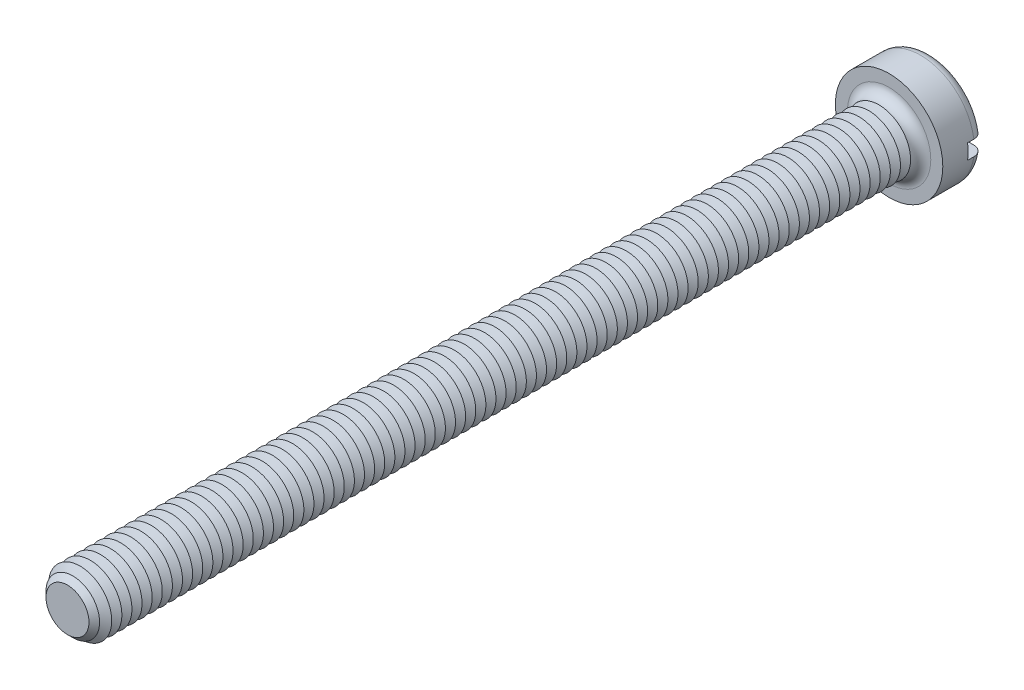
from build123d import *

# Parameters (mm, degrees)
SKETCH3_R           = 4.25
BOSS_EXTRUDE2_DEPTH = 3.3
SKETCH4_R           = 2.5
BOSS_EXTRUDE3_DEPTH = 65
FILLET1_R           = 0.8
CHAMFER1_SIZE       = 0.8
LPATTERN1_COUNT     = 80
LPATTERN1_PITCH     = 0.8
SKETCH8_W           = 8.5
SKETCH8_H           = 1.2
CUT_EXTRUDE1_DEPTH  = 1.3


with BuildPart() as part:
    # Sketch3 → Boss-Extrude2 (new body)
    with BuildSketch(Plane.XY):
        Circle(SKETCH3_R)
    extrude(amount=-BOSS_EXTRUDE2_DEPTH)

    # Sketch4 → Boss-Extrude3 (add)
    with BuildSketch(Plane.XY):
        Circle(SKETCH4_R)
    extrude(amount=BOSS_EXTRUDE3_DEPTH)

    # Fillet1
    fillet1_edges = [part.edges().sort_by_distance(p)[0] for p in [
        (-4.25, 0, -3.3),
        (-2.5, 0, 0),
    ]]
    fillet(fillet1_edges, radius=FILLET1_R)

    # Chamfer1
    chamfer1_edges = [part.edges().sort_by_distance(p)[0] for p in [
        (-2.5, 0, 65),
    ]]
    chamfer(chamfer1_edges, length=CHAMFER1_SIZE)

    # Sketch6 → Cut-Revolve1 (revolve, cut)
    with BuildSketch(Plane(origin=(0, 0, 0), x_dir=(0, 0, -1), z_dir=(1, 0, 0)), mode=Mode.PRIVATE) as cut_revolve1_sk:
        Polygon((-0.8, 2.5), (-1.2, 1.807179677), (-1.6, 2.5), align=None)
    cut_revolve1 = revolve(cut_revolve1_sk.sketch.rotate(Axis((0, 0, -1.694361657), (0, 0, 1)), 90), axis=Axis((0, 0, -1.694361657), (0, 0, 1)), mode=Mode.SUBTRACT)

    # LPattern1: Cut-Revolve1 ×80
    with Locations(*[(0, 0, i * LPATTERN1_PITCH) for i in range(1, LPATTERN1_COUNT)]):
        add(cut_revolve1, mode=Mode.SUBTRACT)

    # Sketch8 → Cut-Extrude1 (cut)
    with BuildSketch(Plane(origin=(0, 0, -3.3), x_dir=(-1, 0, 0), z_dir=(0, 0, -1))):
        Rectangle(SKETCH8_W, SKETCH8_H)
    extrude(amount=-CUT_EXTRUDE1_DEPTH, mode=Mode.SUBTRACT)


solid = part.part
